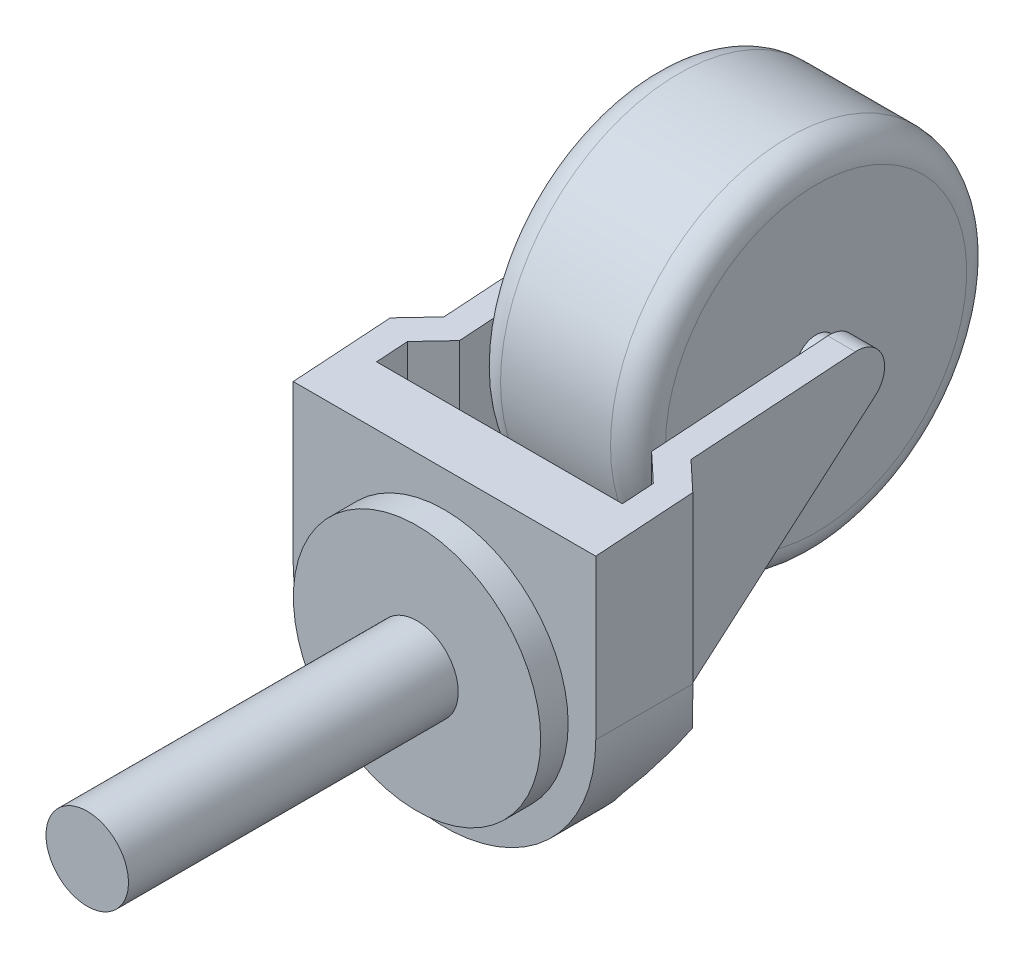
from build123d import *

# Parameters (mm, degrees)
SKETCH1_R          = 4.7625
EXTRUDE1_DEPTH     = 38.1
SKETCH2_R          = 14.2875
EXTRUDE2_DEPTH     = 3.175
EXTRUDE3_DEPTH     = 36.576
CUT_EXTRUDE1_DEPTH = 58.776314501
CUT_EXTRUDE2_DEPTH = 57.811784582
SKETCH8_R          = 2.38125
EXTRUDE5_DEPTH     = 28.540913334


with BuildPart() as part:
    # Sketch1 → Extrude1 (new body)
    with BuildSketch(Plane.XY):
        with Locations(Location((0, 0, 0), (0, 0, 180))):
            Circle(SKETCH1_R)
    extrude(amount=EXTRUDE1_DEPTH)

    # Sketch2 → Extrude2 (add)
    with BuildSketch(Plane.XY):
        Circle(SKETCH2_R)
    extrude(amount=-EXTRUDE2_DEPTH)

    # Sketch3 → Extrude3 (add)
    with BuildSketch(Plane(origin=(0, 0, -3.175), x_dir=(-1, 0, 0), z_dir=(0, 0, -1))):
        with BuildLine():
            Line((-17.4752, 20.6375), (-17.4752, 0))
            ThreePointArc((-17.4752, 0), (0, -17.4752), (17.4752, 0))
            Line((17.4752, 0), (17.4752, 20.6375))
            Line((17.4752, 20.6375), (-17.4752, 20.6375))
        make_face()
    extrude(amount=EXTRUDE3_DEPTH)

    # Sketch4 → Cut-Extrude1 (cut, through all)
    with BuildSketch(Plane(origin=(0, 20.6375, 0), x_dir=(-1, 0, 0), z_dir=(0, 1, 0))):
        Polygon((14.199810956, -9.525), (-14.199810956, -9.525), (-14.199810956, -13.101119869), (-11.095456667, -16.004353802), (-11.095456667, -39.751), (-14.270456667, -39.751), (-14.270456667, -17.382163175), (-20.045675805, -11.981100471), (-20.045675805, -44.764295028), (20.045675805, -44.764295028), (20.045675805, -11.981100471), (14.270456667, -17.382163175), (14.270456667, -39.751), (11.095456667, -39.751), (11.095456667, -16.004353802), (14.199810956, -13.101119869), align=None)
    extrude(amount=-CUT_EXTRUDE1_DEPTH, mode=Mode.SUBTRACT)

    # Sketch5 → Cut-Extrude2 (cut, through all)
    with BuildSketch(Plane(origin=(17.4752, 0, 0), x_dir=(0, 0, -1), z_dir=(1, 0, 0))):
        with BuildLine():
            Line((36.360465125, 20.63017576), (3.175, 18.37217159))
            Line((3.175, 18.37217159), (3.175, 27.510930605))
            Line((3.175, 27.510930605), (43.830320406, 27.510930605))
            Line((43.830320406, 27.510930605), (43.830320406, -25.112448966))
            Line((43.830320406, -25.112448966), (9.525, -25.112448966))
            Line((9.525, -25.112448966), (9.525, -10.044246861))
            Line((9.525, -10.044246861), (38.648846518, 15.05751927))
            ThreePointArc((38.648846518, 15.05751927), (39.513009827, 18.668567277), (36.360465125, 20.63017576))
        make_face()
    extrude(amount=-CUT_EXTRUDE2_DEPTH, mode=Mode.SUBTRACT)



with BuildPart() as body_2:
    # Sketch7 → Revolve1 (revolve)
    with BuildSketch(Plane(origin=(0, 17.4625, 0), x_dir=(-1, 0, 0), z_dir=(0, 1, 0))):
        with BuildLine():
            Line((9.525, -19.177), (9.525, -36.576))
            Line((9.525, -36.576), (-9.525, -36.576))
            Line((-9.525, -36.576), (-9.525, -19.177))
            ThreePointArc((-9.525, -19.177), (-8.59506403, -16.93193597), (-6.35, -16.002))
            Line((-6.35, -16.002), (6.35, -16.002))
            ThreePointArc((6.35, -16.002), (8.59506403, -16.93193597), (9.525, -19.177))
        make_face()
    revolve(axis=Axis((-14.270456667, 17.4625, -36.576), (1, 0, 0)))


with BuildPart() as part_1:
    add(part.part)

    add(body_2.part)  # Extrude5 merges body 2
    # Sketch8 → Extrude5 (add)
    with BuildSketch(Plane(origin=(14.270456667, 0, 0), x_dir=(0, 0, -1), z_dir=(1, 0, 0))):
        with Locations((36.576, 17.4625)):
            Circle(SKETCH8_R)
    extrude(amount=-EXTRUDE5_DEPTH)


solid = part_1.part
